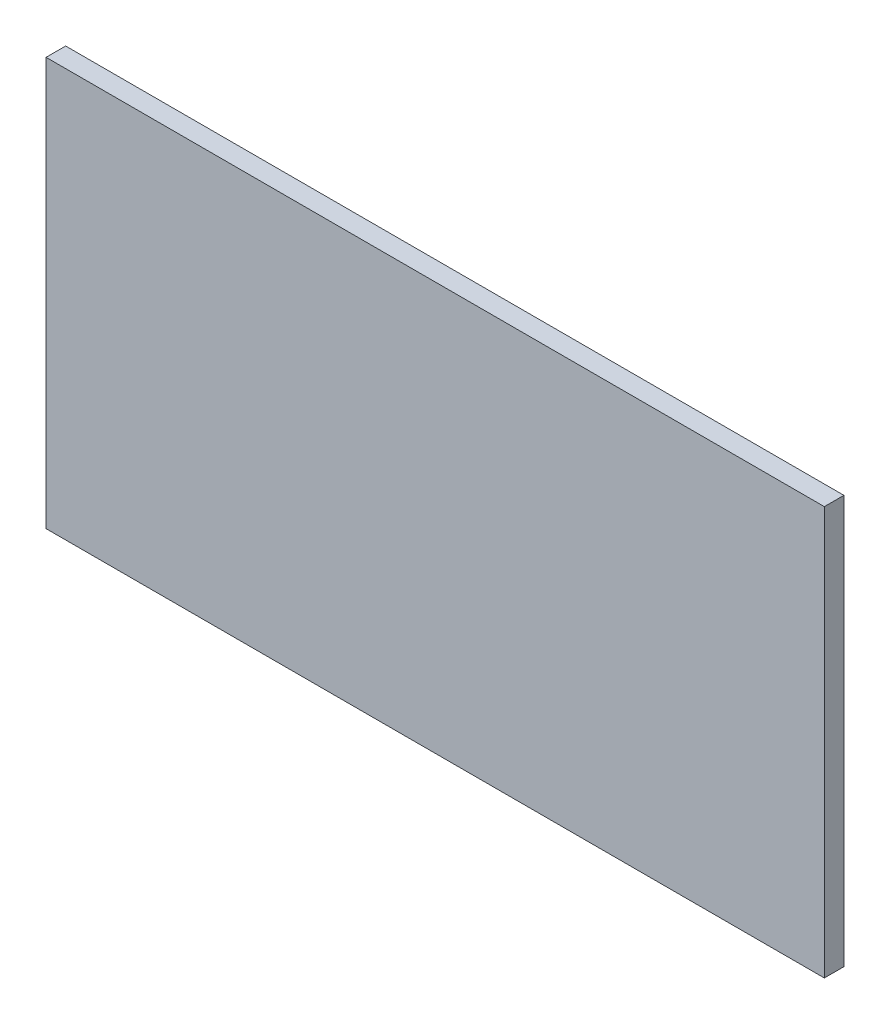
from build123d import *

# Parameters (mm, degrees)
SKETCH_1_W      = 79.5
SKETCH_1_H      = 41.7
EXTRUDE_1_DEPTH = 2


with BuildPart() as part:
    # Sketch 1 → Extrude 1 (new body)
    with BuildSketch(Plane.XY):
        Rectangle(SKETCH_1_W, SKETCH_1_H)
    extrude(amount=EXTRUDE_1_DEPTH)


solid = part.part
